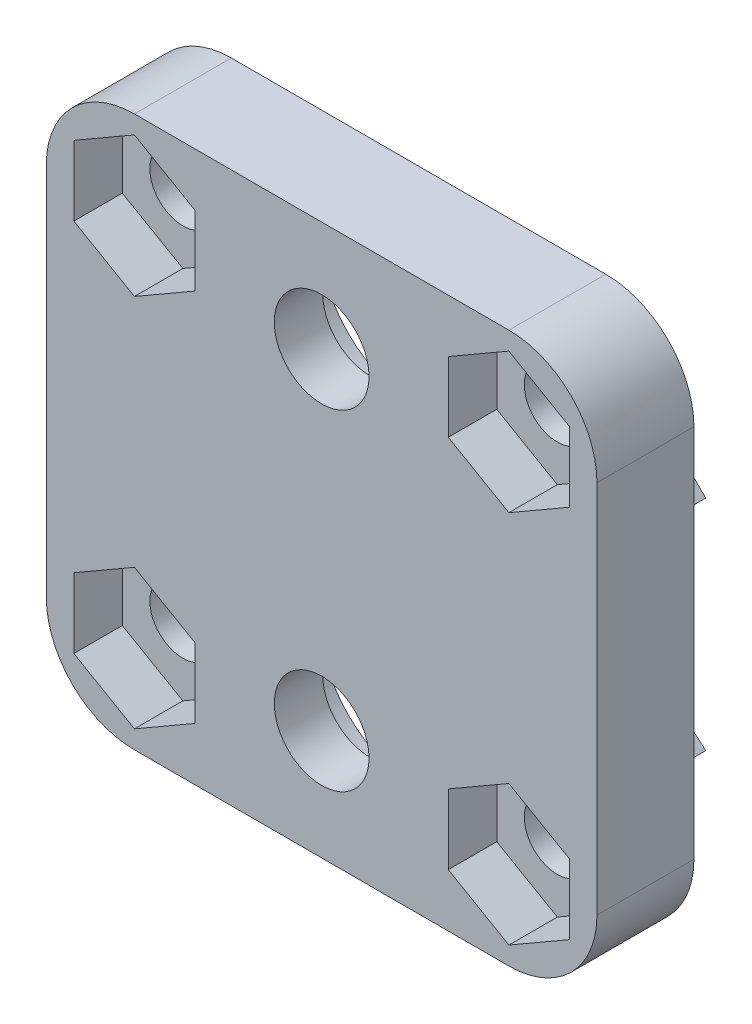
from build123d import *

# Parameters (mm, degrees)
BOSS_EXTRU_1_DEPTH              = 2.2
ENL_V_MAT_EXTRU_1_DEPTH         = 2.2
ESQUISSE3_R                     = 1.5
ENL_V_MAT_EXTRU_2_DEPTH         = 2.2
R_P_TITION_LIN_AIRE1_COUNT      = 10
R_P_TITION_LIN_AIRE1_PITCH      = 17
R_P_TITION_LIN_AIRE1_COUNT_DIR2 = 2
R_P_TITION_LIN_AIRE1_PITCH_DIR2 = 17
ESQUISSE5_R                     = 4.5
ENL_V_MAT_EXTRU_3_DEPTH         = 2.2
ESQUISSE6_R                     = 2.15
ENL_V_MAT_EXTRU_4_DEPTH         = 2.2
BOSS_EXTRU_2_DEPTH              = 1
SYM_TRIE2_COPY_1_DEPTH          = 1


with BuildPart() as part:
    # Esquisse1 → Boss.-Extru.1 (new, symmetric)
    with BuildSketch(Plane.XY):
        with BuildLine():
            Line((17, 21), (0, 21))
            ThreePointArc((0, 21), (-2.828427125, 19.828427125), (-4, 17))
            Line((-4, 17), (-4, 0))
            ThreePointArc((-4, 0), (-2.828427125, -2.828427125), (0, -4))
            Line((0, -4), (17, -4))
            ThreePointArc((17, -4), (19.828427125, -2.828427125), (21, 0))
            Line((21, 0), (21, 17))
            ThreePointArc((21, 17), (19.828427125, 19.828427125), (17, 21))
        make_face()
    extrude(amount=BOSS_EXTRU_1_DEPTH, both=True)

    # Esquisse2 → Enl_v. mat.-Extru.1 (cut)
    with BuildSketch(Plane.XY.offset(2.2)):
        Polygon((19.75, 15.41228676), (19.75, 18.58771324), (17, 20.175426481), (14.25, 18.58771324), (14.25, 15.41228676), (17, 13.824573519), align=None)
    enl_v_mat_extru_1 = extrude(amount=-ENL_V_MAT_EXTRU_1_DEPTH, mode=Mode.SUBTRACT)

    # Esquisse3 → Enl_v. mat.-Extru.2 (cut)
    with BuildSketch(Plane.XY):
        with Locations((17, 17)):
            Circle(ESQUISSE3_R)
    enl_v_mat_extru_2 = extrude(amount=-ENL_V_MAT_EXTRU_2_DEPTH, mode=Mode.SUBTRACT)

    # R_p_tition lin_aire1: Enl_v. mat.-Extru.1, Enl_v. mat.-Extru.2 10 × 2
    with Locations(*[(-i * R_P_TITION_LIN_AIRE1_PITCH, -j * R_P_TITION_LIN_AIRE1_PITCH_DIR2, 0) for i in range(R_P_TITION_LIN_AIRE1_COUNT) for j in range(R_P_TITION_LIN_AIRE1_COUNT_DIR2) if (i, j) != (0, 0)]):
        add(enl_v_mat_extru_1, mode=Mode.SUBTRACT)
        add(enl_v_mat_extru_2, mode=Mode.SUBTRACT)

    # Esquisse5 → Enl_v. mat.-Extru.3 (cut)
    with BuildSketch(Plane(origin=(0, 0, -2.2), x_dir=(-1, 0, 0), z_dir=(0, 0, -1))):
        with Locations((-8.5, 16)):
            Circle(ESQUISSE5_R)
        with Locations((-8.5, 1)):
            Circle(ESQUISSE5_R)
    extrude(amount=-ENL_V_MAT_EXTRU_3_DEPTH, mode=Mode.SUBTRACT)

    # Esquisse6 → Enl_v. mat.-Extru.4 (cut)
    with BuildSketch(Plane(origin=(0, 0, 0), x_dir=(-1, 0, 0), z_dir=(0, 0, -1))):
        with Locations((-8.5, 16)):
            Circle(ESQUISSE6_R)
        with Locations((-8.5, 1)):
            Circle(ESQUISSE6_R)
    extrude(amount=-ENL_V_MAT_EXTRU_4_DEPTH, mode=Mode.SUBTRACT)

    # Esquisse4 → Boss.-Extru.2 (add)
    with BuildSketch(Plane(origin=(0, 0, -2.2), x_dir=(-1, 0, 0), z_dir=(0, 0, -1))):
        with BuildLine():
            Line((-13.723391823, 14.705694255), (-12.904239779, 14.132117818))
            ThreePointArc((-12.904239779, 14.132117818), (-16.564221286, 12.01902651), (-20.535533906, 13.464466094))
            Line((-20.535533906, 13.464466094), (-19.828427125, 14.171572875))
            ThreePointArc((-19.828427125, 14.171572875), (-16.651377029, 13.015221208), (-13.723391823, 14.705694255))
        make_face()
    boss_extru_2 = extrude(amount=BOSS_EXTRU_2_DEPTH)

    # Sym_trie1: Boss.-Extru.2 across plane
    add(boss_extru_2.mirror(Plane.ZX.offset(8.5)))

    # Sym_trie2: Boss.-Extru.2 across plane
    add(boss_extru_2.mirror(Plane(origin=(8.5, 0, 0), x_dir=(0, 0, 1), z_dir=(1, 0, 0))))

    # Sym_trie2 copy 1 sketch → Sym_trie2 copy 1 (add)
    with BuildSketch(Plane(origin=(17, 17, -2.2), x_dir=(1, 0, 0), z_dir=(0, 0, -1))):
        with BuildLine():
            Line((-13.723391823, 14.705694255), (-12.904239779, 14.132117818))
            ThreePointArc((-12.904239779, 14.132117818), (-16.564221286, 12.01902651), (-20.535533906, 13.464466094))
            Line((-20.535533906, 13.464466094), (-19.828427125, 14.171572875))
            ThreePointArc((-19.828427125, 14.171572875), (-16.651377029, 13.015221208), (-13.723391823, 14.705694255))
        make_face()
    extrude(amount=SYM_TRIE2_COPY_1_DEPTH)


solid = part.part
